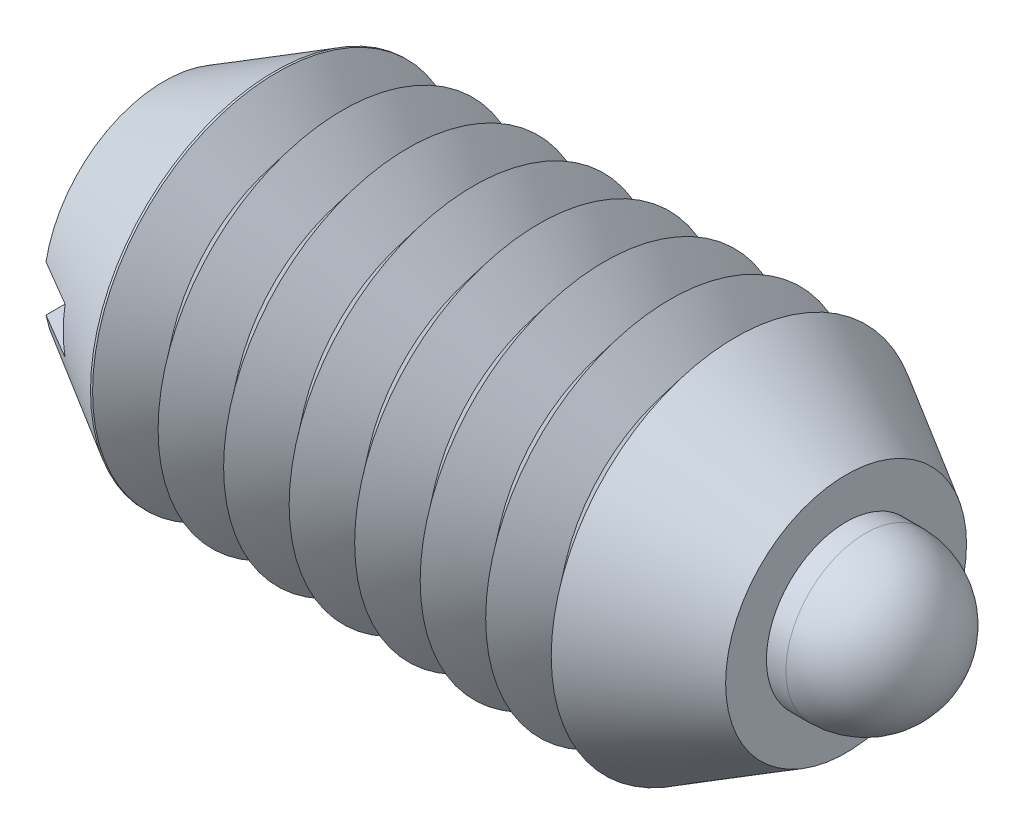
ISO-10303-21;
HEADER;
FILE_DESCRIPTION(('STEP AP214'),'2;1');
FILE_NAME('part.step','',(''),(''),'','','');
FILE_SCHEMA(('AUTOMOTIVE_DESIGN { 1 0 10303 214 1 1 1 1 }'));
ENDSEC;
DATA;
#1=APPLICATION_CONTEXT('core data for automotive mechanical design processes');
#2=APPLICATION_PROTOCOL_DEFINITION('international standard','automotive_design',2000,#1);
#3=PRODUCT_CONTEXT('',#1,'mechanical');
#4=PRODUCT('Part','Part','',(#3));
#5=PRODUCT_RELATED_PRODUCT_CATEGORY('part','',(#4));
#6=PRODUCT_DEFINITION_FORMATION('','',#4);
#7=PRODUCT_DEFINITION_CONTEXT('part definition',#1,'design');
#8=PRODUCT_DEFINITION('design','',#6,#7);
#9=PRODUCT_DEFINITION_SHAPE('','',#8);
#10=(LENGTH_UNIT() NAMED_UNIT(*) SI_UNIT(.MILLI.,.METRE.));
#11=(NAMED_UNIT(*) PLANE_ANGLE_UNIT() SI_UNIT($,.RADIAN.));
#12=(NAMED_UNIT(*) SI_UNIT($,.STERADIAN.) SOLID_ANGLE_UNIT());
#13=UNCERTAINTY_MEASURE_WITH_UNIT(LENGTH_MEASURE(1.E-05),#10,'distance_accuracy_value','');
#14=(GEOMETRIC_REPRESENTATION_CONTEXT(3) GLOBAL_UNCERTAINTY_ASSIGNED_CONTEXT((#13)) GLOBAL_UNIT_ASSIGNED_CONTEXT((#10,
#11,#12)) REPRESENTATION_CONTEXT('',''));
#15=CARTESIAN_POINT('',(0.,0.,0.));
#16=DIRECTION('',(0.,0.,1.));
#17=DIRECTION('',(1.,0.,0.));
#18=AXIS2_PLACEMENT_3D('',#15,#16,#17);
#19=CARTESIAN_POINT('',(10.741025,0.,0.));
#20=DIRECTION('',(-1.,0.,0.));
#21=DIRECTION('',(0.,-0.719424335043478,-0.694570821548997));
#22=AXIS2_PLACEMENT_3D('',#19,#20,#21);
#23=PLANE('',#22);
#24=CARTESIAN_POINT('',(10.741025,0.,0.));
#25=DIRECTION('',(1.,0.,0.));
#26=DIRECTION('',(0.,0.719424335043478,0.694570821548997));
#27=AXIS2_PLACEMENT_3D('',#24,#25,#26);
#28=CIRCLE('',#27,1.7145);
#29=CARTESIAN_POINT('',(10.741025,1.23345302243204,1.19084167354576));
#30=VERTEX_POINT('',#29);
#31=EDGE_CURVE('P0_E10',#30,#30,#28,.T.);
#32=ORIENTED_EDGE('',*,*,#31,.F.);
#33=EDGE_LOOP('',(#32));
#34=FACE_BOUND('',#33,.T.);
#35=ADVANCED_FACE('P0_F14',(#34),#23,.T.);
#36=CARTESIAN_POINT('',(11.083925,0.,0.));
#37=DIRECTION('',(1.,0.,0.));
#38=DIRECTION('',(0.,0.719424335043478,0.694570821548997));
#39=AXIS2_PLACEMENT_3D('',#36,#37,#38);
#40=CONICAL_SURFACE('',#39,2.0574,0.785398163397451);
#41=ORIENTED_EDGE('',*,*,#31,.T.);
#42=EDGE_LOOP('',(#41));
#43=FACE_BOUND('',#42,.T.);
#44=CARTESIAN_POINT('',(11.083925,0.,0.));
#45=DIRECTION('',(1.,0.,0.));
#46=DIRECTION('',(0.,0.719424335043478,0.694570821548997));
#47=AXIS2_PLACEMENT_3D('',#44,#45,#46);
#48=CIRCLE('',#47,2.0574);
#49=CARTESIAN_POINT('',(11.083925,1.48014362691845,1.42901000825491));
#50=VERTEX_POINT('',#49);
#51=EDGE_CURVE('P0_E20',#50,#50,#48,.T.);
#52=ORIENTED_EDGE('',*,*,#51,.F.);
#53=EDGE_LOOP('',(#52));
#54=FACE_BOUND('',#53,.T.);
#55=ADVANCED_FACE('P0_F54',(#43,#54),#40,.T.);
#56=CARTESIAN_POINT('',(16.817975,0.,0.));
#57=DIRECTION('',(1.,0.,0.));
#58=DIRECTION('',(0.,0.719424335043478,0.694570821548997));
#59=AXIS2_PLACEMENT_3D('',#56,#57,#58);
#60=CYLINDRICAL_SURFACE('',#59,2.0574);
#61=ORIENTED_EDGE('',*,*,#51,.T.);
#62=EDGE_LOOP('',(#61));
#63=FACE_BOUND('',#62,.T.);
#64=CARTESIAN_POINT('',(13.5761047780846,0.,0.));
#65=DIRECTION('',(1.,0.,0.));
#66=DIRECTION('',(0.,0.719424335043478,0.694570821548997));
#67=AXIS2_PLACEMENT_3D('',#64,#65,#66);
#68=CIRCLE('',#67,2.0574);
#69=CARTESIAN_POINT('',(13.5761047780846,1.48014362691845,1.42901000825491));
#70=VERTEX_POINT('',#69);
#71=EDGE_CURVE('P0_E24',#70,#70,#68,.T.);
#72=ORIENTED_EDGE('',*,*,#71,.F.);
#73=EDGE_LOOP('',(#72));
#74=FACE_BOUND('',#73,.T.);
#75=ADVANCED_FACE('P0_F50',(#63,#74),#60,.T.);
#76=CARTESIAN_POINT('',(14.170025,0.,0.));
#77=DIRECTION('',(-1.,0.,0.));
#78=DIRECTION('',(0.,-0.719424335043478,-0.694570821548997));
#79=AXIS2_PLACEMENT_3D('',#76,#77,#78);
#80=CONICAL_SURFACE('',#79,1.7145,0.5235987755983);
#81=ORIENTED_EDGE('',*,*,#71,.T.);
#82=EDGE_LOOP('',(#81));
#83=FACE_BOUND('',#82,.T.);
#84=CARTESIAN_POINT('',(14.170025,0.,0.));
#85=DIRECTION('',(1.,0.,0.));
#86=DIRECTION('',(0.,0.719424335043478,0.694570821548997));
#87=AXIS2_PLACEMENT_3D('',#84,#85,#86);
#88=CIRCLE('',#87,1.7145);
#89=CARTESIAN_POINT('',(14.170025,1.23345302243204,1.19084167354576));
#90=VERTEX_POINT('',#89);
#91=EDGE_CURVE('P0_E28',#90,#90,#88,.T.);
#92=ORIENTED_EDGE('',*,*,#91,.F.);
#93=EDGE_LOOP('',(#92));
#94=FACE_BOUND('',#93,.T.);
#95=ADVANCED_FACE('P0_F41',(#83,#94),#80,.T.);
#96=CARTESIAN_POINT('',(16.817975,0.,0.));
#97=DIRECTION('',(1.,0.,0.));
#98=DIRECTION('',(0.,0.719424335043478,0.694570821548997));
#99=AXIS2_PLACEMENT_3D('',#96,#97,#98);
#100=CYLINDRICAL_SURFACE('',#99,1.7145);
#101=ORIENTED_EDGE('',*,*,#91,.T.);
#102=EDGE_LOOP('',(#101));
#103=FACE_BOUND('',#102,.T.);
#104=CARTESIAN_POINT('',(15.103475,0.,0.));
#105=DIRECTION('',(1.,0.,0.));
#106=DIRECTION('',(0.,0.719424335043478,0.694570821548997));
#107=AXIS2_PLACEMENT_3D('',#104,#105,#106);
#108=CIRCLE('',#107,1.7145);
#109=CARTESIAN_POINT('',(15.103475,1.23345302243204,1.19084167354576));
#110=VERTEX_POINT('',#109);
#111=EDGE_CURVE('P0_E33',#110,#110,#108,.T.);
#112=ORIENTED_EDGE('',*,*,#111,.F.);
#113=EDGE_LOOP('',(#112));
#114=FACE_BOUND('',#113,.T.);
#115=ADVANCED_FACE('P0_F39',(#103,#114),#100,.T.);
#116=CARTESIAN_POINT('',(15.103475,0.,0.));
#117=DIRECTION('',(1.,0.,0.));
#118=DIRECTION('',(0.,0.719424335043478,0.694570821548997));
#119=AXIS2_PLACEMENT_3D('',#116,#117,#118);
#120=SPHERICAL_SURFACE('',#119,1.7145);
#121=ORIENTED_EDGE('',*,*,#111,.T.);
#122=EDGE_LOOP('',(#121));
#123=FACE_BOUND('',#122,.T.);
#124=ADVANCED_FACE('P0_F37',(#123),#120,.T.);
#125=CLOSED_SHELL('',(#35,#55,#75,#95,#115,#124));
#126=MANIFOLD_SOLID_BREP('P0_B1',#125);
#127=CARTESIAN_POINT('',(14.684375,0.,0.));
#128=DIRECTION('',(1.,0.,0.));
#129=DIRECTION('',(0.,0.,-1.));
#130=AXIS2_PLACEMENT_3D('',#127,#128,#129);
#131=PLANE('',#130);
#132=CARTESIAN_POINT('',(14.684375,0.,0.));
#133=DIRECTION('',(1.,0.,0.));
#134=DIRECTION('',(0.,0.,-1.));
#135=AXIS2_PLACEMENT_3D('',#132,#133,#134);
#136=CIRCLE('',#135,2.5939346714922);
#137=CARTESIAN_POINT('',(14.684375,0.,-2.5939346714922));
#138=VERTEX_POINT('',#137);
#139=EDGE_CURVE('P1_E81',#138,#138,#136,.T.);
#140=ORIENTED_EDGE('',*,*,#139,.T.);
#141=EDGE_LOOP('',(#140));
#142=FACE_BOUND('',#141,.T.);
#143=CARTESIAN_POINT('',(14.684375,0.,0.));
#144=DIRECTION('',(-1.,0.,0.));
#145=DIRECTION('',(0.,0.,1.));
#146=AXIS2_PLACEMENT_3D('',#143,#144,#145);
#147=CIRCLE('',#146,1.7145);
#148=CARTESIAN_POINT('',(14.684375,0.,1.7145));
#149=VERTEX_POINT('',#148);
#150=EDGE_CURVE('P1_E68',#149,#149,#147,.T.);
#151=ORIENTED_EDGE('',*,*,#150,.T.);
#152=EDGE_LOOP('',(#151));
#153=FACE_BOUND('',#152,.T.);
#154=ADVANCED_FACE('P1_F15',(#142,#153),#131,.T.);
#155=CARTESIAN_POINT('',(14.684375,0.,0.));
#156=DIRECTION('',(-1.,0.,0.));
#157=DIRECTION('',(0.,0.,1.));
#158=AXIS2_PLACEMENT_3D('',#155,#156,#157);
#159=CONICAL_SURFACE('',#158,2.5939346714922,0.523598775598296);
#160=CARTESIAN_POINT('',(12.303125,0.,0.));
#161=DIRECTION('',(-1.,0.,0.));
#162=DIRECTION('',(0.,0.,1.));
#163=AXIS2_PLACEMENT_3D('',#160,#161,#162);
#164=CIRCLE('',#163,3.96875);
#165=CARTESIAN_POINT('',(12.303125,0.,3.96875));
#166=VERTEX_POINT('',#165);
#167=EDGE_CURVE('P1_E163',#166,#166,#164,.T.);
#168=ORIENTED_EDGE('',*,*,#167,.F.);
#169=EDGE_LOOP('',(#168));
#170=FACE_BOUND('',#169,.T.);
#171=ORIENTED_EDGE('',*,*,#139,.F.);
#172=EDGE_LOOP('',(#171));
#173=FACE_BOUND('',#172,.T.);
#174=ADVANCED_FACE('P1_F17',(#170,#173),#159,.T.);
#175=CARTESIAN_POINT('',(0.,0.,0.));
#176=DIRECTION('',(-1.,0.,0.));
#177=DIRECTION('',(0.,0.,1.));
#178=AXIS2_PLACEMENT_3D('',#175,#176,#177);
#179=CYLINDRICAL_SURFACE('',#178,1.7145);
#180=CARTESIAN_POINT('',(14.170025,0.,0.));
#181=DIRECTION('',(-1.,0.,0.));
#182=DIRECTION('',(0.,0.,1.));
#183=AXIS2_PLACEMENT_3D('',#180,#181,#182);
#184=CIRCLE('',#183,1.7145);
#185=CARTESIAN_POINT('',(14.170025,0.,1.7145));
#186=VERTEX_POINT('',#185);
#187=EDGE_CURVE('P1_E175',#186,#186,#184,.T.);
#188=ORIENTED_EDGE('',*,*,#187,.T.);
#189=EDGE_LOOP('',(#188));
#190=FACE_BOUND('',#189,.T.);
#191=ORIENTED_EDGE('',*,*,#150,.F.);
#192=EDGE_LOOP('',(#191));
#193=FACE_BOUND('',#192,.T.);
#194=ADVANCED_FACE('P1_F400',(#190,#193),#179,.F.);
#195=CARTESIAN_POINT('',(14.170025,0.,0.));
#196=DIRECTION('',(-1.,0.,0.));
#197=DIRECTION('',(0.,0.,1.));
#198=AXIS2_PLACEMENT_3D('',#195,#196,#197);
#199=CONICAL_SURFACE('',#198,1.7145,0.785398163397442);
#200=CARTESIAN_POINT('',(13.827125,0.,0.));
#201=DIRECTION('',(-1.,0.,0.));
#202=DIRECTION('',(0.,0.,1.));
#203=AXIS2_PLACEMENT_3D('',#200,#201,#202);
#204=CIRCLE('',#203,2.0574);
#205=CARTESIAN_POINT('',(13.827125,0.,2.0574));
#206=VERTEX_POINT('',#205);
#207=EDGE_CURVE('P1_E172',#206,#206,#204,.T.);
#208=ORIENTED_EDGE('',*,*,#207,.T.);
#209=EDGE_LOOP('',(#208));
#210=FACE_BOUND('',#209,.T.);
#211=ORIENTED_EDGE('',*,*,#187,.F.);
#212=EDGE_LOOP('',(#211));
#213=FACE_BOUND('',#212,.T.);
#214=ADVANCED_FACE('P1_F390',(#210,#213),#199,.F.);
#215=CARTESIAN_POINT('',(0.,0.,0.));
#216=DIRECTION('',(-1.,0.,0.));
#217=DIRECTION('',(0.,0.,1.));
#218=AXIS2_PLACEMENT_3D('',#215,#216,#217);
#219=CYLINDRICAL_SURFACE('',#218,2.0574);
#220=CARTESIAN_POINT('',(2.9765625,0.,0.));
#221=DIRECTION('',(-1.,0.,0.));
#222=DIRECTION('',(0.,0.,1.));
#223=AXIS2_PLACEMENT_3D('',#220,#221,#222);
#224=CIRCLE('',#223,2.0574);
#225=CARTESIAN_POINT('',(2.9765625,0.,2.0574));
#226=VERTEX_POINT('',#225);
#227=EDGE_CURVE('P1_E169',#226,#226,#224,.T.);
#228=ORIENTED_EDGE('',*,*,#227,.T.);
#229=EDGE_LOOP('',(#228));
#230=FACE_BOUND('',#229,.T.);
#231=ORIENTED_EDGE('',*,*,#207,.F.);
#232=EDGE_LOOP('',(#231));
#233=FACE_BOUND('',#232,.T.);
#234=ADVANCED_FACE('P1_F380',(#230,#233),#219,.F.);
#235=CARTESIAN_POINT('',(2.9765625,0.,0.));
#236=DIRECTION('',(1.,0.,0.));
#237=DIRECTION('',(0.,0.,-1.));
#238=AXIS2_PLACEMENT_3D('',#235,#236,#237);
#239=PLANE('',#238);
#240=ORIENTED_EDGE('',*,*,#227,.F.);
#241=EDGE_LOOP('',(#240));
#242=FACE_BOUND('',#241,.T.);
#243=ADVANCED_FACE('P1_F370',(#242),#239,.T.);
#244=CARTESIAN_POINT('',(11.5975694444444,0.,0.));
#245=DIRECTION('',(1.,0.,0.));
#246=DIRECTION('',(0.,0.,-1.));
#247=AXIS2_PLACEMENT_3D('',#244,#245,#246);
#248=CONICAL_SURFACE('',#247,3.08751139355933,0.895664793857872);
#249=ORIENTED_EDGE('',*,*,#167,.T.);
#250=EDGE_LOOP('',(#249));
#251=FACE_BOUND('',#250,.T.);
#252=CARTESIAN_POINT('',(11.5975694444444,0.,0.));
#253=DIRECTION('',(-1.,0.,0.));
#254=DIRECTION('',(0.,0.,1.));
#255=AXIS2_PLACEMENT_3D('',#252,#253,#254);
#256=CIRCLE('',#255,3.08751139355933);
#257=CARTESIAN_POINT('',(11.5975694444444,0.,3.08751139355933));
#258=VERTEX_POINT('',#257);
#259=EDGE_CURVE('P1_E166',#258,#258,#256,.T.);
#260=ORIENTED_EDGE('',*,*,#259,.F.);
#261=EDGE_LOOP('',(#260));
#262=FACE_BOUND('',#261,.T.);
#263=ADVANCED_FACE('P1_F360',(#251,#262),#248,.T.);
#264=CARTESIAN_POINT('',(10.8920138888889,0.,0.));
#265=DIRECTION('',(-1.,0.,0.));
#266=DIRECTION('',(0.,0.,1.));
#267=AXIS2_PLACEMENT_3D('',#264,#265,#266);
#268=CONICAL_SURFACE('',#267,3.96875,0.89566479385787);
#269=ORIENTED_EDGE('',*,*,#259,.T.);
#270=EDGE_LOOP('',(#269));
#271=FACE_BOUND('',#270,.T.);
#272=CARTESIAN_POINT('',(10.8920138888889,0.,0.));
#273=DIRECTION('',(-1.,0.,0.));
#274=DIRECTION('',(0.,0.,1.));
#275=AXIS2_PLACEMENT_3D('',#272,#273,#274);
#276=CIRCLE('',#275,3.96875);
#277=CARTESIAN_POINT('',(10.8920138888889,0.,3.96875));
#278=VERTEX_POINT('',#277);
#279=EDGE_CURVE('P1_E157',#278,#278,#276,.T.);
#280=ORIENTED_EDGE('',*,*,#279,.F.);
#281=EDGE_LOOP('',(#280));
#282=FACE_BOUND('',#281,.T.);
#283=ADVANCED_FACE('P1_F350',(#271,#282),#268,.T.);
#284=CARTESIAN_POINT('',(10.1864583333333,0.,0.));
#285=DIRECTION('',(1.,0.,0.));
#286=DIRECTION('',(0.,0.,-1.));
#287=AXIS2_PLACEMENT_3D('',#284,#285,#286);
#288=CONICAL_SURFACE('',#287,3.08751139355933,0.895664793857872);
#289=ORIENTED_EDGE('',*,*,#279,.T.);
#290=EDGE_LOOP('',(#289));
#291=FACE_BOUND('',#290,.T.);
#292=CARTESIAN_POINT('',(10.1864583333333,0.,0.));
#293=DIRECTION('',(-1.,0.,0.));
#294=DIRECTION('',(0.,0.,1.));
#295=AXIS2_PLACEMENT_3D('',#292,#293,#294);
#296=CIRCLE('',#295,3.08751139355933);
#297=CARTESIAN_POINT('',(10.1864583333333,0.,3.08751139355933));
#298=VERTEX_POINT('',#297);
#299=EDGE_CURVE('P1_E160',#298,#298,#296,.T.);
#300=ORIENTED_EDGE('',*,*,#299,.F.);
#301=EDGE_LOOP('',(#300));
#302=FACE_BOUND('',#301,.T.);
#303=ADVANCED_FACE('P1_F340',(#291,#302),#288,.T.);
#304=CARTESIAN_POINT('',(9.48090277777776,0.,0.));
#305=DIRECTION('',(-1.,0.,0.));
#306=DIRECTION('',(0.,0.,1.));
#307=AXIS2_PLACEMENT_3D('',#304,#305,#306);
#308=CONICAL_SURFACE('',#307,3.96875,0.89566479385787);
#309=ORIENTED_EDGE('',*,*,#299,.T.);
#310=EDGE_LOOP('',(#309));
#311=FACE_BOUND('',#310,.T.);
#312=CARTESIAN_POINT('',(9.48090277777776,0.,0.));
#313=DIRECTION('',(-1.,0.,0.));
#314=DIRECTION('',(0.,0.,1.));
#315=AXIS2_PLACEMENT_3D('',#312,#313,#314);
#316=CIRCLE('',#315,3.96875);
#317=CARTESIAN_POINT('',(9.48090277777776,0.,3.96875));
#318=VERTEX_POINT('',#317);
#319=EDGE_CURVE('P1_E151',#318,#318,#316,.T.);
#320=ORIENTED_EDGE('',*,*,#319,.F.);
#321=EDGE_LOOP('',(#320));
#322=FACE_BOUND('',#321,.T.);
#323=ADVANCED_FACE('P1_F330',(#311,#322),#308,.T.);
#324=CARTESIAN_POINT('',(8.77534722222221,0.,0.));
#325=DIRECTION('',(1.,0.,0.));
#326=DIRECTION('',(0.,0.,-1.));
#327=AXIS2_PLACEMENT_3D('',#324,#325,#326);
#328=CONICAL_SURFACE('',#327,3.08751139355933,0.895664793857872);
#329=ORIENTED_EDGE('',*,*,#319,.T.);
#330=EDGE_LOOP('',(#329));
#331=FACE_BOUND('',#330,.T.);
#332=CARTESIAN_POINT('',(8.77534722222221,0.,0.));
#333=DIRECTION('',(-1.,0.,0.));
#334=DIRECTION('',(0.,0.,1.));
#335=AXIS2_PLACEMENT_3D('',#332,#333,#334);
#336=CIRCLE('',#335,3.08751139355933);
#337=CARTESIAN_POINT('',(8.77534722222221,0.,3.08751139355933));
#338=VERTEX_POINT('',#337);
#339=EDGE_CURVE('P1_E154',#338,#338,#336,.T.);
#340=ORIENTED_EDGE('',*,*,#339,.F.);
#341=EDGE_LOOP('',(#340));
#342=FACE_BOUND('',#341,.T.);
#343=ADVANCED_FACE('P1_F320',(#331,#342),#328,.T.);
#344=CARTESIAN_POINT('',(8.06979166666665,0.,0.));
#345=DIRECTION('',(-1.,0.,0.));
#346=DIRECTION('',(0.,0.,1.));
#347=AXIS2_PLACEMENT_3D('',#344,#345,#346);
#348=CONICAL_SURFACE('',#347,3.96875,0.89566479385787);
#349=ORIENTED_EDGE('',*,*,#339,.T.);
#350=EDGE_LOOP('',(#349));
#351=FACE_BOUND('',#350,.T.);
#352=CARTESIAN_POINT('',(8.06979166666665,0.,0.));
#353=DIRECTION('',(-1.,0.,0.));
#354=DIRECTION('',(0.,0.,1.));
#355=AXIS2_PLACEMENT_3D('',#352,#353,#354);
#356=CIRCLE('',#355,3.96875);
#357=CARTESIAN_POINT('',(8.06979166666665,0.,3.96875));
#358=VERTEX_POINT('',#357);
#359=EDGE_CURVE('P1_E145',#358,#358,#356,.T.);
#360=ORIENTED_EDGE('',*,*,#359,.F.);
#361=EDGE_LOOP('',(#360));
#362=FACE_BOUND('',#361,.T.);
#363=ADVANCED_FACE('P1_F310',(#351,#362),#348,.T.);
#364=CARTESIAN_POINT('',(7.36423611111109,0.,0.));
#365=DIRECTION('',(1.,0.,0.));
#366=DIRECTION('',(0.,0.,-1.));
#367=AXIS2_PLACEMENT_3D('',#364,#365,#366);
#368=CONICAL_SURFACE('',#367,3.08751139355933,0.895664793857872);
#369=ORIENTED_EDGE('',*,*,#359,.T.);
#370=EDGE_LOOP('',(#369));
#371=FACE_BOUND('',#370,.T.);
#372=CARTESIAN_POINT('',(7.36423611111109,0.,0.));
#373=DIRECTION('',(-1.,0.,0.));
#374=DIRECTION('',(0.,0.,1.));
#375=AXIS2_PLACEMENT_3D('',#372,#373,#374);
#376=CIRCLE('',#375,3.08751139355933);
#377=CARTESIAN_POINT('',(7.36423611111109,0.,3.08751139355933));
#378=VERTEX_POINT('',#377);
#379=EDGE_CURVE('P1_E148',#378,#378,#376,.T.);
#380=ORIENTED_EDGE('',*,*,#379,.F.);
#381=EDGE_LOOP('',(#380));
#382=FACE_BOUND('',#381,.T.);
#383=ADVANCED_FACE('P1_F300',(#371,#382),#368,.T.);
#384=CARTESIAN_POINT('',(6.65868055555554,0.,0.));
#385=DIRECTION('',(-1.,0.,0.));
#386=DIRECTION('',(0.,0.,1.));
#387=AXIS2_PLACEMENT_3D('',#384,#385,#386);
#388=CONICAL_SURFACE('',#387,3.96875,0.89566479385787);
#389=ORIENTED_EDGE('',*,*,#379,.T.);
#390=EDGE_LOOP('',(#389));
#391=FACE_BOUND('',#390,.T.);
#392=CARTESIAN_POINT('',(6.65868055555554,0.,0.));
#393=DIRECTION('',(-1.,0.,0.));
#394=DIRECTION('',(0.,0.,1.));
#395=AXIS2_PLACEMENT_3D('',#392,#393,#394);
#396=CIRCLE('',#395,3.96875);
#397=CARTESIAN_POINT('',(6.65868055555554,0.,3.96875));
#398=VERTEX_POINT('',#397);
#399=EDGE_CURVE('P1_E139',#398,#398,#396,.T.);
#400=ORIENTED_EDGE('',*,*,#399,.F.);
#401=EDGE_LOOP('',(#400));
#402=FACE_BOUND('',#401,.T.);
#403=ADVANCED_FACE('P1_F290',(#391,#402),#388,.T.);
#404=CARTESIAN_POINT('',(5.95312499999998,0.,0.));
#405=DIRECTION('',(1.,0.,0.));
#406=DIRECTION('',(0.,0.,-1.));
#407=AXIS2_PLACEMENT_3D('',#404,#405,#406);
#408=CONICAL_SURFACE('',#407,3.08751139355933,0.895664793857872);
#409=ORIENTED_EDGE('',*,*,#399,.T.);
#410=EDGE_LOOP('',(#409));
#411=FACE_BOUND('',#410,.T.);
#412=CARTESIAN_POINT('',(5.95312499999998,0.,0.));
#413=DIRECTION('',(-1.,0.,0.));
#414=DIRECTION('',(0.,0.,1.));
#415=AXIS2_PLACEMENT_3D('',#412,#413,#414);
#416=CIRCLE('',#415,3.08751139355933);
#417=CARTESIAN_POINT('',(5.95312499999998,0.,3.08751139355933));
#418=VERTEX_POINT('',#417);
#419=EDGE_CURVE('P1_E142',#418,#418,#416,.T.);
#420=ORIENTED_EDGE('',*,*,#419,.F.);
#421=EDGE_LOOP('',(#420));
#422=FACE_BOUND('',#421,.T.);
#423=ADVANCED_FACE('P1_F280',(#411,#422),#408,.T.);
#424=CARTESIAN_POINT('',(5.24756944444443,0.,0.));
#425=DIRECTION('',(-1.,0.,0.));
#426=DIRECTION('',(0.,0.,1.));
#427=AXIS2_PLACEMENT_3D('',#424,#425,#426);
#428=CONICAL_SURFACE('',#427,3.96875,0.89566479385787);
#429=ORIENTED_EDGE('',*,*,#419,.T.);
#430=EDGE_LOOP('',(#429));
#431=FACE_BOUND('',#430,.T.);
#432=CARTESIAN_POINT('',(5.24756944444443,0.,0.));
#433=DIRECTION('',(-1.,0.,0.));
#434=DIRECTION('',(0.,0.,1.));
#435=AXIS2_PLACEMENT_3D('',#432,#433,#434);
#436=CIRCLE('',#435,3.96875);
#437=CARTESIAN_POINT('',(5.24756944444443,0.,3.96875));
#438=VERTEX_POINT('',#437);
#439=EDGE_CURVE('P1_E129',#438,#438,#436,.T.);
#440=ORIENTED_EDGE('',*,*,#439,.F.);
#441=EDGE_LOOP('',(#440));
#442=FACE_BOUND('',#441,.T.);
#443=ADVANCED_FACE('P1_F270',(#431,#442),#428,.T.);
#444=CARTESIAN_POINT('',(4.54201388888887,0.,0.));
#445=DIRECTION('',(1.,0.,0.));
#446=DIRECTION('',(0.,0.,-1.));
#447=AXIS2_PLACEMENT_3D('',#444,#445,#446);
#448=CONICAL_SURFACE('',#447,3.08751139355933,0.895664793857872);
#449=ORIENTED_EDGE('',*,*,#439,.T.);
#450=EDGE_LOOP('',(#449));
#451=FACE_BOUND('',#450,.T.);
#452=CARTESIAN_POINT('',(4.54201388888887,0.,0.));
#453=DIRECTION('',(-1.,0.,0.));
#454=DIRECTION('',(0.,0.,1.));
#455=AXIS2_PLACEMENT_3D('',#452,#453,#454);
#456=CIRCLE('',#455,3.08751139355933);
#457=CARTESIAN_POINT('',(4.54201388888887,0.,3.08751139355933));
#458=VERTEX_POINT('',#457);
#459=EDGE_CURVE('P1_E136',#458,#458,#456,.T.);
#460=ORIENTED_EDGE('',*,*,#459,.F.);
#461=EDGE_LOOP('',(#460));
#462=FACE_BOUND('',#461,.T.);
#463=ADVANCED_FACE('P1_F260',(#451,#462),#448,.T.);
#464=CARTESIAN_POINT('',(3.83645833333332,0.,0.));
#465=DIRECTION('',(-1.,0.,0.));
#466=DIRECTION('',(0.,0.,1.));
#467=AXIS2_PLACEMENT_3D('',#464,#465,#466);
#468=CONICAL_SURFACE('',#467,3.96875,0.89566479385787);
#469=ORIENTED_EDGE('',*,*,#459,.T.);
#470=EDGE_LOOP('',(#469));
#471=FACE_BOUND('',#470,.T.);
#472=CARTESIAN_POINT('',(3.83645833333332,0.,0.));
#473=DIRECTION('',(-1.,0.,0.));
#474=DIRECTION('',(0.,0.,1.));
#475=AXIS2_PLACEMENT_3D('',#472,#473,#474);
#476=CIRCLE('',#475,3.96875);
#477=CARTESIAN_POINT('',(3.83645833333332,0.,3.96875));
#478=VERTEX_POINT('',#477);
#479=EDGE_CURVE('P1_E126',#478,#478,#476,.T.);
#480=ORIENTED_EDGE('',*,*,#479,.F.);
#481=EDGE_LOOP('',(#480));
#482=FACE_BOUND('',#481,.T.);
#483=ADVANCED_FACE('P1_F250',(#471,#482),#468,.T.);
#484=CARTESIAN_POINT('',(3.13090277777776,0.,0.));
#485=DIRECTION('',(1.,0.,0.));
#486=DIRECTION('',(0.,0.,-1.));
#487=AXIS2_PLACEMENT_3D('',#484,#485,#486);
#488=CONICAL_SURFACE('',#487,3.08751139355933,0.895664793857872);
#489=ORIENTED_EDGE('',*,*,#479,.T.);
#490=EDGE_LOOP('',(#489));
#491=FACE_BOUND('',#490,.T.);
#492=CARTESIAN_POINT('',(3.13090277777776,0.,0.));
#493=DIRECTION('',(-1.,0.,0.));
#494=DIRECTION('',(0.,0.,1.));
#495=AXIS2_PLACEMENT_3D('',#492,#493,#494);
#496=CIRCLE('',#495,3.08751139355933);
#497=CARTESIAN_POINT('',(3.13090277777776,0.,3.08751139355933));
#498=VERTEX_POINT('',#497);
#499=EDGE_CURVE('P1_E125',#498,#498,#496,.T.);
#500=ORIENTED_EDGE('',*,*,#499,.F.);
#501=EDGE_LOOP('',(#500));
#502=FACE_BOUND('',#501,.T.);
#503=ADVANCED_FACE('P1_F240',(#491,#502),#488,.T.);
#504=CARTESIAN_POINT('',(2.42534722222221,0.,0.));
#505=DIRECTION('',(-1.,0.,0.));
#506=DIRECTION('',(0.,0.,1.));
#507=AXIS2_PLACEMENT_3D('',#504,#505,#506);
#508=CONICAL_SURFACE('',#507,3.96875,0.89566479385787);
#509=ORIENTED_EDGE('',*,*,#499,.T.);
#510=EDGE_LOOP('',(#509));
#511=FACE_BOUND('',#510,.T.);
#512=CARTESIAN_POINT('',(2.42534722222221,0.,0.));
#513=DIRECTION('',(-1.,0.,0.));
#514=DIRECTION('',(0.,0.,1.));
#515=AXIS2_PLACEMENT_3D('',#512,#513,#514);
#516=CIRCLE('',#515,3.96875);
#517=CARTESIAN_POINT('',(2.42534722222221,0.,3.96875));
#518=VERTEX_POINT('',#517);
#519=EDGE_CURVE('P1_E123',#518,#518,#516,.T.);
#520=ORIENTED_EDGE('',*,*,#519,.F.);
#521=EDGE_LOOP('',(#520));
#522=FACE_BOUND('',#521,.T.);
#523=ADVANCED_FACE('P1_F110',(#511,#522),#508,.T.);
#524=CARTESIAN_POINT('',(0.,0.,0.));
#525=DIRECTION('',(1.,0.,0.));
#526=DIRECTION('',(0.,0.,-1.));
#527=AXIS2_PLACEMENT_3D('',#524,#525,#526);
#528=PLANE('',#527);
#529=CARTESIAN_POINT('',(0.,0.,0.));
#530=DIRECTION('',(1.,0.,0.));
#531=DIRECTION('',(0.,0.,-1.));
#532=AXIS2_PLACEMENT_3D('',#529,#530,#531);
#533=CIRCLE('',#532,2.5939346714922);
#534=CARTESIAN_POINT('',(0.,-0.49609375,-2.5460534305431));
#535=VERTEX_POINT('',#534);
#536=CARTESIAN_POINT('',(0.,-0.49609375,2.5460534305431));
#537=VERTEX_POINT('',#536);
#538=EDGE_CURVE('P1_E77',#535,#537,#533,.F.);
#539=ORIENTED_EDGE('',*,*,#538,.T.);
#540=DIRECTION('',(0.,0.,1.));
#541=VECTOR('',#540,1.);
#542=CARTESIAN_POINT('',(0.,-0.49609375,-3.96875));
#543=LINE('',#542,#541);
#544=EDGE_CURVE('P1_E35',#535,#537,#543,.T.);
#545=ORIENTED_EDGE('',*,*,#544,.F.);
#546=EDGE_LOOP('',(#539,#545));
#547=FACE_BOUND('',#546,.T.);
#548=ADVANCED_FACE('P1_F101',(#547),#528,.F.);
#549=CARTESIAN_POINT('',(0.,-0.49609375,-3.96875));
#550=DIRECTION('',(0.,-1.,0.));
#551=DIRECTION('',(0.,0.,-1.));
#552=AXIS2_PLACEMENT_3D('',#549,#550,#551);
#553=PLANE('',#552);
#554=CARTESIAN_POINT('',(5.79195031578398,-0.49609375,-5.91715894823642));
#555=CARTESIAN_POINT('',(5.50277108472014,-0.49609375,-5.74961309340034));
#556=CARTESIAN_POINT('',(5.21361142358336,-0.49609375,-5.58203343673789));
#557=CARTESIAN_POINT('',(4.63534852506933,-0.49609375,-5.24677609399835));
#558=CARTESIAN_POINT('',(4.34624528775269,-0.49609375,-5.07909840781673));
#559=CARTESIAN_POINT('',(3.76805625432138,-0.49609375,-4.74358192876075));
#560=CARTESIAN_POINT('',(3.47897047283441,-0.49609375,-4.57574311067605));
#561=CARTESIAN_POINT('',(2.90090210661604,-0.49609375,-4.23988840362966));
#562=CARTESIAN_POINT('',(2.61191952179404,-0.49609375,-4.07187251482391));
#563=CARTESIAN_POINT('',(2.04163523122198,-0.49609375,-3.73997081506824));
#564=CARTESIAN_POINT('',(1.76032972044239,-0.49609375,-3.57609154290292));
#565=CARTESIAN_POINT('',(1.19792631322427,-0.49609375,-3.24797522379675));
#566=CARTESIAN_POINT('',(0.916828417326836,-0.49609375,-3.08373817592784));
#567=CARTESIAN_POINT('',(0.355013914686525,-0.49609375,-2.7547236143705));
#568=CARTESIAN_POINT('',(0.074297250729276,-0.49609375,-2.58994619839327));
#569=CARTESIAN_POINT('',(-0.486572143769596,-0.49609375,-2.25943551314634));
#570=CARTESIAN_POINT('',(-0.766724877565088,-0.49609375,-2.09370224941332));
#571=CARTESIAN_POINT('',(-1.18687015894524,-0.49609375,-1.84321237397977));
#572=CARTESIAN_POINT('',(-1.32728734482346,-0.49609375,-1.75916900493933));
#573=CARTESIAN_POINT('',(-1.60772111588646,-0.49609375,-1.59030830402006));
#574=CARTESIAN_POINT('',(-1.74773754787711,-0.49609375,-1.50549071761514));
#575=CARTESIAN_POINT('',(-2.02850231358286,-0.49609375,-1.33379801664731));
#576=CARTESIAN_POINT('',(-2.16924322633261,-0.49609375,-1.24691069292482));
#577=CARTESIAN_POINT('',(-2.3792690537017,-0.49609375,-1.11499964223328));
#578=CARTESIAN_POINT('',(-2.44906317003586,-0.49609375,-1.07078776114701));
#579=CARTESIAN_POINT('',(-2.58815620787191,-0.49609375,-0.981594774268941));
#580=CARTESIAN_POINT('',(-2.65745514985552,-0.49609375,-0.936613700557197));
#581=CARTESIAN_POINT('',(-2.79536618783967,-0.49609375,-0.84548183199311));
#582=CARTESIAN_POINT('',(-2.86397764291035,-0.49609375,-0.799330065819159));
#583=CARTESIAN_POINT('',(-3.00019503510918,-0.49609375,-0.705144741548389));
#584=CARTESIAN_POINT('',(-3.06779769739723,-0.49609375,-0.657106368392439));
#585=CARTESIAN_POINT('',(-3.16718437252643,-0.49609375,-0.583010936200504));
#586=CARTESIAN_POINT('',(-3.19982047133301,-0.49609375,-0.558100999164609));
#587=CARTESIAN_POINT('',(-3.26427750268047,-0.49609375,-0.50725232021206));
#588=CARTESIAN_POINT('',(-3.29609862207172,-0.49609375,-0.481313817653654));
#589=CARTESIAN_POINT('',(-3.35837630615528,-0.49609375,-0.428097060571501));
#590=CARTESIAN_POINT('',(-3.38883802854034,-0.49609375,-0.4008248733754));
#591=CARTESIAN_POINT('',(-3.44774560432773,-0.49609375,-0.344201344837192));
#592=CARTESIAN_POINT('',(-3.47619467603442,-0.49609375,-0.314853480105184));
#593=CARTESIAN_POINT('',(-3.51236741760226,-0.49609375,-0.272791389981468));
#594=CARTESIAN_POINT('',(-3.5216929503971,-0.49609375,-0.261465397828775));
#595=CARTESIAN_POINT('',(-3.539723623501,-0.49609375,-0.238327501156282));
#596=CARTESIAN_POINT('',(-3.54842847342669,-0.49609375,-0.226515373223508));
#597=CARTESIAN_POINT('',(-3.5733044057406,-0.49609375,-0.190322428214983));
#598=CARTESIAN_POINT('',(-3.58832504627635,-0.49609375,-0.165087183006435));
#599=CARTESIAN_POINT('',(-3.60827262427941,-0.49609375,-0.122261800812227));
#600=CARTESIAN_POINT('',(-3.61486054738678,-0.49609375,-0.105457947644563));
#601=CARTESIAN_POINT('',(-3.62530354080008,-0.49609375,-0.071011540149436));
#602=CARTESIAN_POINT('',(-3.62916226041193,-0.49609375,-0.053370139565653));
#603=CARTESIAN_POINT('',(-3.6335928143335,-0.49609375,-0.0175056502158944));
#604=CARTESIAN_POINT('',(-3.6341361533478,-0.49609375,0.000721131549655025));
#605=CARTESIAN_POINT('',(-3.63176024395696,-0.49609375,0.0369425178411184));
#606=CARTESIAN_POINT('',(-3.62883947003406,-0.49609375,0.0549370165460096));
#607=CARTESIAN_POINT('',(-3.61909302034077,-0.49609375,0.0938433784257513));
#608=CARTESIAN_POINT('',(-3.61157744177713,-0.49609375,0.114576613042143));
#609=CARTESIAN_POINT('',(-3.59342326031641,-0.49609375,0.154629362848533));
#610=CARTESIAN_POINT('',(-3.58277520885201,-0.49609375,0.173944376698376));
#611=CARTESIAN_POINT('',(-3.55594062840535,-0.49609375,0.216760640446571));
#612=CARTESIAN_POINT('',(-3.53904762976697,-0.49609375,0.239808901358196));
#613=CARTESIAN_POINT('',(-3.50313314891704,-0.49609375,0.284206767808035));
#614=CARTESIAN_POINT('',(-3.48410699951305,-0.49609375,0.305552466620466));
#615=CARTESIAN_POINT('',(-3.44457317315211,-0.49609375,0.347090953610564));
#616=CARTESIAN_POINT('',(-3.42405616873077,-0.49609375,0.367274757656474));
#617=CARTESIAN_POINT('',(-3.382126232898,-0.49609375,0.406629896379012));
#618=CARTESIAN_POINT('',(-3.36071431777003,-0.49609375,0.425802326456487));
#619=CARTESIAN_POINT('',(-3.2907490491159,-0.49609375,0.486347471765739));
#620=CARTESIAN_POINT('',(-3.24094932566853,-0.49609375,0.526271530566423));
#621=CARTESIAN_POINT('',(-3.13972167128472,-0.49609375,0.604012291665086));
#622=CARTESIAN_POINT('',(-3.08829268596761,-0.49609375,0.641827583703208));
#623=CARTESIAN_POINT('',(-2.98434500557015,-0.49609375,0.716155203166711));
#624=CARTESIAN_POINT('',(-2.93182430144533,-0.49609375,0.752664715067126));
#625=CARTESIAN_POINT('',(-2.82616042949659,-0.49609375,0.824731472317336));
#626=CARTESIAN_POINT('',(-2.773017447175,-0.49609375,0.860288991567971));
#627=CARTESIAN_POINT('',(-2.6664016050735,-0.49609375,0.93065760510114));
#628=CARTESIAN_POINT('',(-2.61292967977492,-0.49609375,0.965470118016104));
#629=CARTESIAN_POINT('',(-2.50566261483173,-0.49609375,1.03460093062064));
#630=CARTESIAN_POINT('',(-2.45186745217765,-0.49609375,1.0689191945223));
#631=CARTESIAN_POINT('',(-2.29025977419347,-0.49609375,1.17123054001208));
#632=CARTESIAN_POINT('',(-2.18209427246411,-0.49609375,1.23866553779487));
#633=CARTESIAN_POINT('',(-1.96583716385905,-0.49609375,1.37222479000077));
#634=CARTESIAN_POINT('',(-1.85774886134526,-0.49609375,1.43835441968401));
#635=CARTESIAN_POINT('',(-1.64119983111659,-0.49609375,1.57000167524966));
#636=CARTESIAN_POINT('',(-1.53273910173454,-0.49609375,1.63551929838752));
#637=CARTESIAN_POINT('',(-1.2069712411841,-0.49609375,1.83144622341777));
#638=CARTESIAN_POINT('',(-0.989285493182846,-0.49609375,1.96122526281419));
#639=CARTESIAN_POINT('',(-0.553265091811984,-0.49609375,2.21994162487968));
#640=CARTESIAN_POINT('',(-0.334930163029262,-0.49609375,2.34887848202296));
#641=CARTESIAN_POINT('',(0.102067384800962,-0.49609375,2.60618739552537));
#642=CARTESIAN_POINT('',(0.320729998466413,-0.49609375,2.73455946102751));
#643=CARTESIAN_POINT('',(0.758134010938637,-0.49609375,2.99085756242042));
#644=CARTESIAN_POINT('',(0.97687527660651,-0.49609375,3.11878382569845));
#645=CARTESIAN_POINT('',(1.41450717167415,-0.49609375,3.37438268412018));
#646=CARTESIAN_POINT('',(1.63339780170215,-0.49609375,3.502055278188));
#647=CARTESIAN_POINT('',(2.29016069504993,-0.49609375,3.88476586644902));
#648=CARTESIAN_POINT('',(2.72818957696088,-0.49609375,4.13953504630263));
#649=CARTESIAN_POINT('',(3.38501577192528,-0.49609375,4.52115962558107));
#650=CARTESIAN_POINT('',(3.6037254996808,-0.49609375,4.6481658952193));
#651=CARTESIAN_POINT('',(4.04120019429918,-0.49609375,4.90210197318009));
#652=CARTESIAN_POINT('',(4.25996516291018,-0.49609375,5.02903177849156));
#653=CARTESIAN_POINT('',(4.69758712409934,-0.49609375,5.28285970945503));
#654=CARTESIAN_POINT('',(4.91644412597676,-0.49609375,5.40975781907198));
#655=CARTESIAN_POINT('',(5.35418025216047,-0.49609375,5.6634970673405));
#656=CARTESIAN_POINT('',(5.57305937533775,-0.49609375,5.79033820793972));
#657=CARTESIAN_POINT('',(5.79195031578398,-0.49609375,5.91715894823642));
#658=B_SPLINE_CURVE_WITH_KNOTS('',3,(#554,#555,#556,#557,#558,#559,#560,#561,#562,#563,#564,
#565,#566,#567,#568,#569,#570,#571,#572,#573,#574,#575,#576,#577,#578,#579,#580,#581,#582,#583,
#584,#585,#586,#587,#588,#589,#590,#591,#592,#593,#594,#595,#596,#597,#598,#599,#600,#601,#602,
#603,#604,#605,#606,#607,#608,#609,#610,#611,#612,#613,#614,#615,#616,#617,#618,#619,#620,#621,
#622,#623,#624,#625,#626,#627,#628,#629,#630,#631,#632,#633,#634,#635,#636,#637,#638,#639,#640,
#641,#642,#643,#644,#645,#646,#647,#648,#649,#650,#651,#652,#653,#654,#655,#656,#657),
.UNSPECIFIED.,.F.,.F.,(4,2,2,2,2,2,2,2,2,2,2,2,2,2,2,2,2,2,2,2,2,2,2,2,2,2,2,2,2,2,2,2,2,2,2,2,
2,2,2,2,2,2,2,2,2,2,2,2,2,2,2,4),(0.,1.00262964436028,2.00526035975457,3.0080883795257,
4.01091551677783,4.98759488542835,5.96427679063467,6.94079088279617,7.9172993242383,
8.40823801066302,8.89934436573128,9.39553304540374,9.64338721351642,9.89123106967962,
10.1392877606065,10.3880249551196,10.5111808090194,10.6343081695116,10.7569197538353,
10.8793306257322,10.9233232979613,10.9673364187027,11.0549692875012,11.1089442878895,
11.1628469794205,11.2172123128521,11.2716015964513,11.3373858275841,11.4033705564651,
11.488885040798,11.5745904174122,11.6608879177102,11.7470899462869,11.9384470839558,
12.1299306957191,12.3218049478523,12.5136233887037,12.7050364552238,12.8964633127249,
13.2788485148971,13.6589855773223,14.0391243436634,14.7994266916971,15.5601187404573,
16.320798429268,17.0810059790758,17.8412167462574,19.3614102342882,20.120146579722,
20.8789110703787,21.6378667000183,22.3967940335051),.UNSPECIFIED.);
#659=CARTESIAN_POINT('',(0.9921875,-0.49609375,-3.12767502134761));
#660=VERTEX_POINT('',#659);
#661=EDGE_CURVE('P1_E93',#660,#535,#658,.T.);
#662=ORIENTED_EDGE('',*,*,#661,.T.);
#663=ORIENTED_EDGE('',*,*,#544,.T.);
#664=CARTESIAN_POINT('',(0.9921875,-0.49609375,3.12767502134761));
#665=VERTEX_POINT('',#664);
#666=EDGE_CURVE('P1_E88',#537,#665,#658,.T.);
#667=ORIENTED_EDGE('',*,*,#666,.T.);
#668=DIRECTION('',(0.,0.,1.));
#669=VECTOR('',#668,1.);
#670=CARTESIAN_POINT('',(0.9921875,-0.49609375,-3.96875));
#671=LINE('',#670,#669);
#672=EDGE_CURVE('P1_E181',#660,#665,#671,.T.);
#673=ORIENTED_EDGE('',*,*,#672,.F.);
#674=EDGE_LOOP('',(#662,#663,#667,#673));
#675=FACE_BOUND('',#674,.T.);
#676=ADVANCED_FACE('P1_F96',(#675),#553,.F.);
#677=CARTESIAN_POINT('',(0.9921875,0.49609375,-3.96875));
#678=DIRECTION('',(1.,0.,0.));
#679=DIRECTION('',(0.,0.,-1.));
#680=AXIS2_PLACEMENT_3D('',#677,#678,#679);
#681=PLANE('',#680);
#682=CARTESIAN_POINT('',(0.9921875,0.,0.));
#683=DIRECTION('',(1.,0.,0.));
#684=DIRECTION('',(0.,0.,-1.));
#685=AXIS2_PLACEMENT_3D('',#682,#683,#684);
#686=CIRCLE('',#685,3.16677439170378);
#687=CARTESIAN_POINT('',(0.9921875,0.49609375,3.12767502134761));
#688=VERTEX_POINT('',#687);
#689=EDGE_CURVE('P1_E43',#665,#688,#686,.F.);
#690=ORIENTED_EDGE('',*,*,#689,.T.);
#691=DIRECTION('',(0.,0.,1.));
#692=VECTOR('',#691,1.);
#693=CARTESIAN_POINT('',(0.9921875,0.49609375,-3.96875));
#694=LINE('',#693,#692);
#695=CARTESIAN_POINT('',(0.9921875,0.49609375,-3.12767502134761));
#696=VERTEX_POINT('',#695);
#697=EDGE_CURVE('P1_E83',#696,#688,#694,.T.);
#698=ORIENTED_EDGE('',*,*,#697,.F.);
#699=EDGE_CURVE('P1_E28',#696,#660,#686,.F.);
#700=ORIENTED_EDGE('',*,*,#699,.T.);
#701=ORIENTED_EDGE('',*,*,#672,.T.);
#702=EDGE_LOOP('',(#690,#698,#700,#701));
#703=FACE_BOUND('',#702,.T.);
#704=ADVANCED_FACE('P1_F100',(#703),#681,.F.);
#705=CARTESIAN_POINT('',(0.,0.49609375,2.5460534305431));
#706=VERTEX_POINT('',#705);
#707=CARTESIAN_POINT('',(0.,0.49609375,-2.5460534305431));
#708=VERTEX_POINT('',#707);
#709=EDGE_CURVE('P1_E74',#706,#708,#533,.F.);
#710=ORIENTED_EDGE('',*,*,#709,.T.);
#711=DIRECTION('',(0.,0.,1.));
#712=VECTOR('',#711,1.);
#713=CARTESIAN_POINT('',(0.,0.49609375,-3.96875));
#714=LINE('',#713,#712);
#715=EDGE_CURVE('P1_E61',#708,#706,#714,.T.);
#716=ORIENTED_EDGE('',*,*,#715,.T.);
#717=EDGE_LOOP('',(#710,#716));
#718=FACE_BOUND('',#717,.T.);
#719=ADVANCED_FACE('P1_F76',(#718),#528,.F.);
#720=CARTESIAN_POINT('',(0.,0.49609375,-3.96875));
#721=DIRECTION('',(0.,1.,0.));
#722=DIRECTION('',(0.,0.,1.));
#723=AXIS2_PLACEMENT_3D('',#720,#721,#722);
#724=PLANE('',#723);
#725=CARTESIAN_POINT('',(5.79195031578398,0.49609375,5.91715894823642));
#726=CARTESIAN_POINT('',(5.50277108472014,0.49609375,5.74961309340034));
#727=CARTESIAN_POINT('',(5.21361142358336,0.49609375,5.58203343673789));
#728=CARTESIAN_POINT('',(4.63534852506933,0.49609375,5.24677609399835));
#729=CARTESIAN_POINT('',(4.34624528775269,0.49609375,5.07909840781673));
#730=CARTESIAN_POINT('',(3.76805625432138,0.49609375,4.74358192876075));
#731=CARTESIAN_POINT('',(3.47897047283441,0.49609375,4.57574311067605));
#732=CARTESIAN_POINT('',(2.90090210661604,0.49609375,4.23988840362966));
#733=CARTESIAN_POINT('',(2.61191952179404,0.49609375,4.07187251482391));
#734=CARTESIAN_POINT('',(2.04163523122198,0.49609375,3.73997081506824));
#735=CARTESIAN_POINT('',(1.76032972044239,0.49609375,3.57609154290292));
#736=CARTESIAN_POINT('',(1.19792631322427,0.49609375,3.24797522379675));
#737=CARTESIAN_POINT('',(0.916828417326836,0.49609375,3.08373817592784));
#738=CARTESIAN_POINT('',(0.355013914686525,0.49609375,2.7547236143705));
#739=CARTESIAN_POINT('',(0.074297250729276,0.49609375,2.58994619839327));
#740=CARTESIAN_POINT('',(-0.486572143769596,0.49609375,2.25943551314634));
#741=CARTESIAN_POINT('',(-0.766724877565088,0.49609375,2.09370224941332));
#742=CARTESIAN_POINT('',(-1.18687015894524,0.49609375,1.84321237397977));
#743=CARTESIAN_POINT('',(-1.32728734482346,0.49609375,1.75916900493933));
#744=CARTESIAN_POINT('',(-1.60772111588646,0.49609375,1.59030830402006));
#745=CARTESIAN_POINT('',(-1.74773754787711,0.49609375,1.50549071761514));
#746=CARTESIAN_POINT('',(-2.02850231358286,0.49609375,1.33379801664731));
#747=CARTESIAN_POINT('',(-2.16924322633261,0.49609375,1.24691069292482));
#748=CARTESIAN_POINT('',(-2.3792690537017,0.49609375,1.11499964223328));
#749=CARTESIAN_POINT('',(-2.44906317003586,0.49609375,1.07078776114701));
#750=CARTESIAN_POINT('',(-2.58815620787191,0.49609375,0.981594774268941));
#751=CARTESIAN_POINT('',(-2.65745514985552,0.49609375,0.936613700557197));
#752=CARTESIAN_POINT('',(-2.79536618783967,0.49609375,0.84548183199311));
#753=CARTESIAN_POINT('',(-2.86397764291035,0.49609375,0.799330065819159));
#754=CARTESIAN_POINT('',(-3.00019503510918,0.49609375,0.705144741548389));
#755=CARTESIAN_POINT('',(-3.06779769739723,0.49609375,0.657106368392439));
#756=CARTESIAN_POINT('',(-3.16718437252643,0.49609375,0.583010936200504));
#757=CARTESIAN_POINT('',(-3.19982047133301,0.49609375,0.558100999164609));
#758=CARTESIAN_POINT('',(-3.26427750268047,0.49609375,0.50725232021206));
#759=CARTESIAN_POINT('',(-3.29609862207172,0.49609375,0.481313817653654));
#760=CARTESIAN_POINT('',(-3.35837630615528,0.49609375,0.428097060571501));
#761=CARTESIAN_POINT('',(-3.38883802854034,0.49609375,0.4008248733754));
#762=CARTESIAN_POINT('',(-3.44774560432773,0.49609375,0.344201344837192));
#763=CARTESIAN_POINT('',(-3.47619467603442,0.49609375,0.314853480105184));
#764=CARTESIAN_POINT('',(-3.51236741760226,0.49609375,0.272791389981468));
#765=CARTESIAN_POINT('',(-3.5216929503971,0.49609375,0.261465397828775));
#766=CARTESIAN_POINT('',(-3.539723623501,0.49609375,0.238327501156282));
#767=CARTESIAN_POINT('',(-3.54842847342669,0.49609375,0.226515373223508));
#768=CARTESIAN_POINT('',(-3.5733044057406,0.49609375,0.190322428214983));
#769=CARTESIAN_POINT('',(-3.58832504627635,0.49609375,0.165087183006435));
#770=CARTESIAN_POINT('',(-3.60827262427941,0.49609375,0.122261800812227));
#771=CARTESIAN_POINT('',(-3.61486054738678,0.49609375,0.105457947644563));
#772=CARTESIAN_POINT('',(-3.62530354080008,0.49609375,0.071011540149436));
#773=CARTESIAN_POINT('',(-3.62916226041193,0.49609375,0.053370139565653));
#774=CARTESIAN_POINT('',(-3.6335928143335,0.49609375,0.0175056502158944));
#775=CARTESIAN_POINT('',(-3.6341361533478,0.49609375,-0.000721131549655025));
#776=CARTESIAN_POINT('',(-3.63176024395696,0.49609375,-0.0369425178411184));
#777=CARTESIAN_POINT('',(-3.62883947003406,0.49609375,-0.0549370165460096));
#778=CARTESIAN_POINT('',(-3.61909302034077,0.49609375,-0.0938433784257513));
#779=CARTESIAN_POINT('',(-3.61157744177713,0.49609375,-0.114576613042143));
#780=CARTESIAN_POINT('',(-3.59342326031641,0.49609375,-0.154629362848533));
#781=CARTESIAN_POINT('',(-3.58277520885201,0.49609375,-0.173944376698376));
#782=CARTESIAN_POINT('',(-3.55594062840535,0.49609375,-0.216760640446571));
#783=CARTESIAN_POINT('',(-3.53904762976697,0.49609375,-0.239808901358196));
#784=CARTESIAN_POINT('',(-3.50313314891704,0.49609375,-0.284206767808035));
#785=CARTESIAN_POINT('',(-3.48410699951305,0.49609375,-0.305552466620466));
#786=CARTESIAN_POINT('',(-3.44457317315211,0.49609375,-0.347090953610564));
#787=CARTESIAN_POINT('',(-3.42405616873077,0.49609375,-0.367274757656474));
#788=CARTESIAN_POINT('',(-3.382126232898,0.49609375,-0.406629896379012));
#789=CARTESIAN_POINT('',(-3.36071431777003,0.49609375,-0.425802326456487));
#790=CARTESIAN_POINT('',(-3.2907490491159,0.49609375,-0.486347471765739));
#791=CARTESIAN_POINT('',(-3.24094932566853,0.49609375,-0.526271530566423));
#792=CARTESIAN_POINT('',(-3.13972167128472,0.49609375,-0.604012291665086));
#793=CARTESIAN_POINT('',(-3.08829268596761,0.49609375,-0.641827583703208));
#794=CARTESIAN_POINT('',(-2.98434500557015,0.49609375,-0.716155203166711));
#795=CARTESIAN_POINT('',(-2.93182430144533,0.49609375,-0.752664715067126));
#796=CARTESIAN_POINT('',(-2.82616042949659,0.49609375,-0.824731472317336));
#797=CARTESIAN_POINT('',(-2.773017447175,0.49609375,-0.860288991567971));
#798=CARTESIAN_POINT('',(-2.6664016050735,0.49609375,-0.93065760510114));
#799=CARTESIAN_POINT('',(-2.61292967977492,0.49609375,-0.965470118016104));
#800=CARTESIAN_POINT('',(-2.50566261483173,0.49609375,-1.03460093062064));
#801=CARTESIAN_POINT('',(-2.45186745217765,0.49609375,-1.0689191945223));
#802=CARTESIAN_POINT('',(-2.29025977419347,0.49609375,-1.17123054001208));
#803=CARTESIAN_POINT('',(-2.18209427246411,0.49609375,-1.23866553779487));
#804=CARTESIAN_POINT('',(-1.96583716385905,0.49609375,-1.37222479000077));
#805=CARTESIAN_POINT('',(-1.85774886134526,0.49609375,-1.43835441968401));
#806=CARTESIAN_POINT('',(-1.64119983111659,0.49609375,-1.57000167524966));
#807=CARTESIAN_POINT('',(-1.53273910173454,0.49609375,-1.63551929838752));
#808=CARTESIAN_POINT('',(-1.2069712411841,0.49609375,-1.83144622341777));
#809=CARTESIAN_POINT('',(-0.989285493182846,0.49609375,-1.96122526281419));
#810=CARTESIAN_POINT('',(-0.553265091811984,0.49609375,-2.21994162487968));
#811=CARTESIAN_POINT('',(-0.334930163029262,0.49609375,-2.34887848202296));
#812=CARTESIAN_POINT('',(0.102067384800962,0.49609375,-2.60618739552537));
#813=CARTESIAN_POINT('',(0.320729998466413,0.49609375,-2.73455946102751));
#814=CARTESIAN_POINT('',(0.758134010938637,0.49609375,-2.99085756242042));
#815=CARTESIAN_POINT('',(0.97687527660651,0.49609375,-3.11878382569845));
#816=CARTESIAN_POINT('',(1.41450717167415,0.49609375,-3.37438268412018));
#817=CARTESIAN_POINT('',(1.63339780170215,0.49609375,-3.502055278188));
#818=CARTESIAN_POINT('',(2.29016069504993,0.49609375,-3.88476586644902));
#819=CARTESIAN_POINT('',(2.72818957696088,0.49609375,-4.13953504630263));
#820=CARTESIAN_POINT('',(3.38501577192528,0.49609375,-4.52115962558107));
#821=CARTESIAN_POINT('',(3.6037254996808,0.49609375,-4.6481658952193));
#822=CARTESIAN_POINT('',(4.04120019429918,0.49609375,-4.90210197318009));
#823=CARTESIAN_POINT('',(4.25996516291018,0.49609375,-5.02903177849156));
#824=CARTESIAN_POINT('',(4.69758712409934,0.49609375,-5.28285970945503));
#825=CARTESIAN_POINT('',(4.91644412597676,0.49609375,-5.40975781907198));
#826=CARTESIAN_POINT('',(5.35418025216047,0.49609375,-5.6634970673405));
#827=CARTESIAN_POINT('',(5.57305937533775,0.49609375,-5.79033820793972));
#828=CARTESIAN_POINT('',(5.79195031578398,0.49609375,-5.91715894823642));
#829=B_SPLINE_CURVE_WITH_KNOTS('',3,(#725,#726,#727,#728,#729,#730,#731,#732,#733,#734,#735,
#736,#737,#738,#739,#740,#741,#742,#743,#744,#745,#746,#747,#748,#749,#750,#751,#752,#753,#754,
#755,#756,#757,#758,#759,#760,#761,#762,#763,#764,#765,#766,#767,#768,#769,#770,#771,#772,#773,
#774,#775,#776,#777,#778,#779,#780,#781,#782,#783,#784,#785,#786,#787,#788,#789,#790,#791,#792,
#793,#794,#795,#796,#797,#798,#799,#800,#801,#802,#803,#804,#805,#806,#807,#808,#809,#810,#811,
#812,#813,#814,#815,#816,#817,#818,#819,#820,#821,#822,#823,#824,#825,#826,#827,#828),
.UNSPECIFIED.,.F.,.F.,(4,2,2,2,2,2,2,2,2,2,2,2,2,2,2,2,2,2,2,2,2,2,2,2,2,2,2,2,2,2,2,2,2,2,2,2,
2,2,2,2,2,2,2,2,2,2,2,2,2,2,2,4),(0.,1.00262964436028,2.00526035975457,3.0080883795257,
4.01091551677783,4.98759488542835,5.96427679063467,6.94079088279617,7.9172993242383,
8.40823801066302,8.89934436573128,9.39553304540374,9.64338721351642,9.89123106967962,
10.1392877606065,10.3880249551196,10.5111808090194,10.6343081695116,10.7569197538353,
10.8793306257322,10.9233232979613,10.9673364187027,11.0549692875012,11.1089442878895,
11.1628469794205,11.2172123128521,11.2716015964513,11.3373858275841,11.4033705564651,
11.488885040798,11.5745904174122,11.6608879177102,11.7470899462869,11.9384470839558,
12.1299306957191,12.3218049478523,12.5136233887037,12.7050364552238,12.8964633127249,
13.2788485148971,13.6589855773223,14.0391243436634,14.7994266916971,15.5601187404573,
16.320798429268,17.0810059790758,17.8412167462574,19.3614102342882,20.120146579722,
20.8789110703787,21.6378667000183,22.3967940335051),.UNSPECIFIED.);
#830=EDGE_CURVE('P1_E19',#688,#706,#829,.T.);
#831=ORIENTED_EDGE('',*,*,#830,.T.);
#832=ORIENTED_EDGE('',*,*,#715,.F.);
#833=EDGE_CURVE('P1_E10',#708,#696,#829,.T.);
#834=ORIENTED_EDGE('',*,*,#833,.T.);
#835=ORIENTED_EDGE('',*,*,#697,.T.);
#836=EDGE_LOOP('',(#831,#832,#834,#835));
#837=FACE_BOUND('',#836,.T.);
#838=ADVANCED_FACE('P1_F63',(#837),#724,.F.);
#839=CARTESIAN_POINT('',(2.38125000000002,0.,0.));
#840=DIRECTION('',(1.,0.,0.));
#841=DIRECTION('',(0.,0.,-1.));
#842=AXIS2_PLACEMENT_3D('',#839,#840,#841);
#843=CONICAL_SURFACE('',#842,3.96875,0.523598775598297);
#844=ORIENTED_EDGE('',*,*,#833,.F.);
#845=ORIENTED_EDGE('',*,*,#709,.F.);
#846=ORIENTED_EDGE('',*,*,#830,.F.);
#847=ORIENTED_EDGE('',*,*,#689,.F.);
#848=ORIENTED_EDGE('',*,*,#666,.F.);
#849=ORIENTED_EDGE('',*,*,#538,.F.);
#850=ORIENTED_EDGE('',*,*,#661,.F.);
#851=ORIENTED_EDGE('',*,*,#699,.F.);
#852=EDGE_LOOP('',(#844,#845,#846,#847,#848,#849,#850,#851));
#853=FACE_BOUND('',#852,.T.);
#854=CARTESIAN_POINT('',(2.38125000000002,0.,0.));
#855=DIRECTION('',(1.,0.,0.));
#856=DIRECTION('',(0.,0.,-1.));
#857=AXIS2_PLACEMENT_3D('',#854,#855,#856);
#858=CIRCLE('',#857,3.96875);
#859=CARTESIAN_POINT('',(2.38125000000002,0.,-3.96875));
#860=VERTEX_POINT('',#859);
#861=EDGE_CURVE('P1_E78',#860,#860,#858,.T.);
#862=ORIENTED_EDGE('',*,*,#861,.F.);
#863=EDGE_LOOP('',(#862));
#864=FACE_BOUND('',#863,.T.);
#865=ADVANCED_FACE('P1_F72',(#853,#864),#843,.T.);
#866=CARTESIAN_POINT('',(14.684375,0.,0.));
#867=DIRECTION('',(-1.,0.,0.));
#868=DIRECTION('',(0.,0.,1.));
#869=AXIS2_PLACEMENT_3D('',#866,#867,#868);
#870=CYLINDRICAL_SURFACE('',#869,3.96875);
#871=ORIENTED_EDGE('',*,*,#861,.T.);
#872=EDGE_LOOP('',(#871));
#873=FACE_BOUND('',#872,.T.);
#874=ORIENTED_EDGE('',*,*,#519,.T.);
#875=EDGE_LOOP('',(#874));
#876=FACE_BOUND('',#875,.T.);
#877=ADVANCED_FACE('P1_F112',(#873,#876),#870,.T.);
#878=CLOSED_SHELL('',(#154,#174,#194,#214,#234,#243,#263,#283,#303,#323,#343,#363,#383,#403,
#423,#443,#463,#483,#503,#523,#548,#676,#704,#719,#838,#865,#877));
#879=MANIFOLD_SOLID_BREP('P1_B1',#878);
#880=ADVANCED_BREP_SHAPE_REPRESENTATION('',(#18,#126,#879),#14);
#881=SHAPE_DEFINITION_REPRESENTATION(#9,#880);
ENDSEC;
END-ISO-10303-21;
